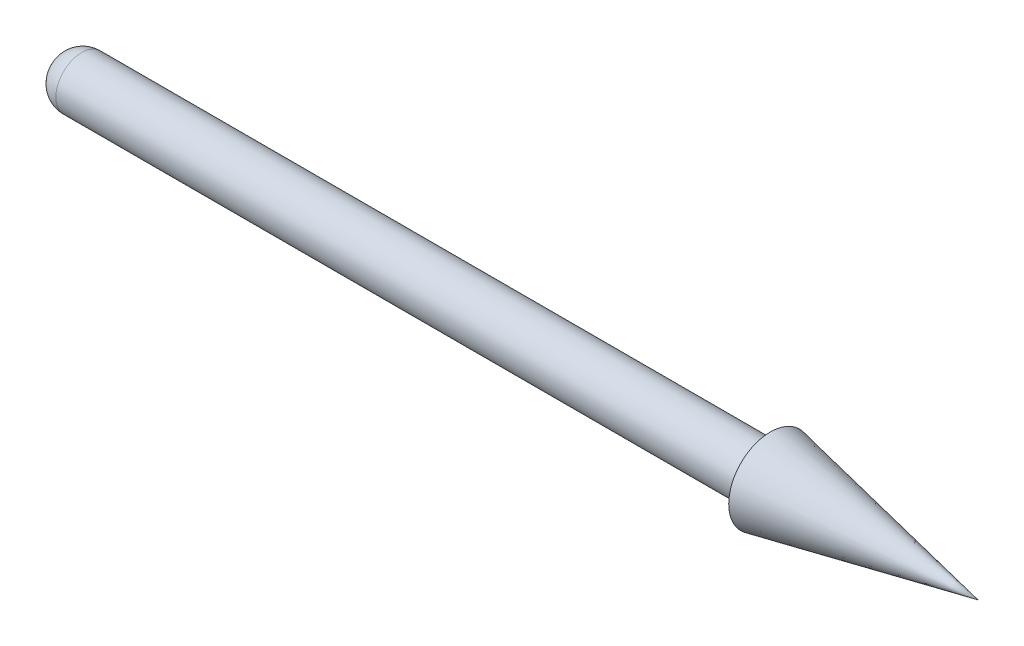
ISO-10303-21;
HEADER;
FILE_DESCRIPTION(('STEP AP214'),'2;1');
FILE_NAME('part.step','',(''),(''),'','','');
FILE_SCHEMA(('AUTOMOTIVE_DESIGN { 1 0 10303 214 1 1 1 1 }'));
ENDSEC;
DATA;
#1=APPLICATION_CONTEXT('core data for automotive mechanical design processes');
#2=APPLICATION_PROTOCOL_DEFINITION('international standard','automotive_design',2000,#1);
#3=PRODUCT_CONTEXT('',#1,'mechanical');
#4=PRODUCT('Part','Part','',(#3));
#5=PRODUCT_RELATED_PRODUCT_CATEGORY('part','',(#4));
#6=PRODUCT_DEFINITION_FORMATION('','',#4);
#7=PRODUCT_DEFINITION_CONTEXT('part definition',#1,'design');
#8=PRODUCT_DEFINITION('design','',#6,#7);
#9=PRODUCT_DEFINITION_SHAPE('','',#8);
#10=(LENGTH_UNIT() NAMED_UNIT(*) SI_UNIT(.MILLI.,.METRE.));
#11=(NAMED_UNIT(*) PLANE_ANGLE_UNIT() SI_UNIT($,.RADIAN.));
#12=(NAMED_UNIT(*) SI_UNIT($,.STERADIAN.) SOLID_ANGLE_UNIT());
#13=UNCERTAINTY_MEASURE_WITH_UNIT(LENGTH_MEASURE(1.E-05),#10,'distance_accuracy_value','');
#14=(GEOMETRIC_REPRESENTATION_CONTEXT(3) GLOBAL_UNCERTAINTY_ASSIGNED_CONTEXT((#13)) GLOBAL_UNIT_ASSIGNED_CONTEXT((#10,
#11,#12)) REPRESENTATION_CONTEXT('',''));
#15=CARTESIAN_POINT('',(0.,0.,0.));
#16=DIRECTION('',(0.,0.,1.));
#17=DIRECTION('',(1.,0.,0.));
#18=AXIS2_PLACEMENT_3D('',#15,#16,#17);
#19=CARTESIAN_POINT('',(-1.,0.0742342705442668,0.));
#20=DIRECTION('',(1.,0.,0.));
#21=DIRECTION('',(0.,0.,-1.));
#22=AXIS2_PLACEMENT_3D('',#19,#20,#21);
#23=PLANE('',#22);
#24=CARTESIAN_POINT('',(-1.,0.,0.));
#25=DIRECTION('',(-1.,0.,0.));
#26=DIRECTION('',(0.,0.,1.));
#27=AXIS2_PLACEMENT_3D('',#24,#25,#26);
#28=CIRCLE('',#27,0.0742342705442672);
#29=CARTESIAN_POINT('',(-1.,0.,0.0742342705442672));
#30=VERTEX_POINT('',#29);
#31=EDGE_CURVE('E67',#30,#30,#28,.T.);
#32=ORIENTED_EDGE('',*,*,#31,.T.);
#33=EDGE_LOOP('',(#32));
#34=FACE_BOUND('',#33,.T.);
#35=ADVANCED_FACE('F33',(#34),#23,.F.);
#36=CARTESIAN_POINT('',(30.,0.,0.));
#37=DIRECTION('',(-1.,0.,0.));
#38=DIRECTION('',(0.,0.,1.));
#39=AXIS2_PLACEMENT_3D('',#36,#37,#38);
#40=CONICAL_SURFACE('',#39,0.,0.197395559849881);
#41=CARTESIAN_POINT('',(23.,0.,0.));
#42=DIRECTION('',(-1.,0.,0.));
#43=DIRECTION('',(0.,0.,1.));
#44=AXIS2_PLACEMENT_3D('',#41,#42,#43);
#45=CIRCLE('',#44,1.4);
#46=CARTESIAN_POINT('',(23.,0.,1.4));
#47=VERTEX_POINT('',#46);
#48=EDGE_CURVE('E11',#47,#47,#45,.T.);
#49=ORIENTED_EDGE('',*,*,#48,.F.);
#50=EDGE_LOOP('',(#49));
#51=FACE_BOUND('',#50,.T.);
#52=CARTESIAN_POINT('',(30.,0.,0.));
#53=VERTEX_POINT('',#52);
#54=VERTEX_LOOP('',#53);
#55=FACE_BOUND('',#54,.T.);
#56=ADVANCED_FACE('F42',(#51,#55),#40,.T.);
#57=CARTESIAN_POINT('',(23.,0.874234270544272,0.));
#58=DIRECTION('',(1.,0.,0.));
#59=DIRECTION('',(0.,0.,-1.));
#60=AXIS2_PLACEMENT_3D('',#57,#58,#59);
#61=PLANE('',#60);
#62=CARTESIAN_POINT('',(23.,0.,0.));
#63=DIRECTION('',(-1.,0.,0.));
#64=DIRECTION('',(0.,0.,1.));
#65=AXIS2_PLACEMENT_3D('',#62,#63,#64);
#66=CIRCLE('',#65,0.874234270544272);
#67=CARTESIAN_POINT('',(23.,0.,0.874234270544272));
#68=VERTEX_POINT('',#67);
#69=EDGE_CURVE('E39',#68,#68,#66,.T.);
#70=ORIENTED_EDGE('',*,*,#69,.F.);
#71=EDGE_LOOP('',(#70));
#72=FACE_BOUND('',#71,.T.);
#73=ORIENTED_EDGE('',*,*,#48,.T.);
#74=EDGE_LOOP('',(#73));
#75=FACE_BOUND('',#74,.T.);
#76=ADVANCED_FACE('F44',(#72,#75),#61,.F.);
#77=CARTESIAN_POINT('',(-1.,0.,0.));
#78=DIRECTION('',(-1.,0.,0.));
#79=DIRECTION('',(0.,0.,1.));
#80=AXIS2_PLACEMENT_3D('',#77,#78,#79);
#81=CYLINDRICAL_SURFACE('',#80,0.874234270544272);
#82=CARTESIAN_POINT('',(-0.199999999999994,0.,0.));
#83=DIRECTION('',(-1.,0.,0.));
#84=DIRECTION('',(0.,0.,1.));
#85=AXIS2_PLACEMENT_3D('',#82,#83,#84);
#86=CIRCLE('',#85,0.874234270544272);
#87=CARTESIAN_POINT('',(-0.199999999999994,0.,0.874234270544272));
#88=VERTEX_POINT('',#87);
#89=EDGE_CURVE('E70',#88,#88,#86,.T.);
#90=ORIENTED_EDGE('',*,*,#89,.F.);
#91=EDGE_LOOP('',(#90));
#92=FACE_BOUND('',#91,.T.);
#93=ORIENTED_EDGE('',*,*,#69,.T.);
#94=EDGE_LOOP('',(#93));
#95=FACE_BOUND('',#94,.T.);
#96=ADVANCED_FACE('F50',(#92,#95),#81,.T.);
#97=CARTESIAN_POINT('',(-0.2,0.,0.));
#98=DIRECTION('',(-1.,0.,0.));
#99=DIRECTION('',(0.,0.,1.));
#100=AXIS2_PLACEMENT_3D('',#97,#98,#99);
#101=DEGENERATE_TOROIDAL_SURFACE('',#100,0.0742342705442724,0.8,.T.);
#102=ORIENTED_EDGE('',*,*,#31,.F.);
#103=EDGE_LOOP('',(#102));
#104=FACE_BOUND('',#103,.T.);
#105=ORIENTED_EDGE('',*,*,#89,.T.);
#106=EDGE_LOOP('',(#105));
#107=FACE_BOUND('',#106,.T.);
#108=ADVANCED_FACE('F58',(#104,#107),#101,.T.);
#109=CLOSED_SHELL('',(#35,#56,#76,#96,#108));
#110=MANIFOLD_SOLID_BREP('B2',#109);
#111=ADVANCED_BREP_SHAPE_REPRESENTATION('',(#18,#110),#14);
#112=SHAPE_DEFINITION_REPRESENTATION(#9,#111);
ENDSEC;
END-ISO-10303-21;
